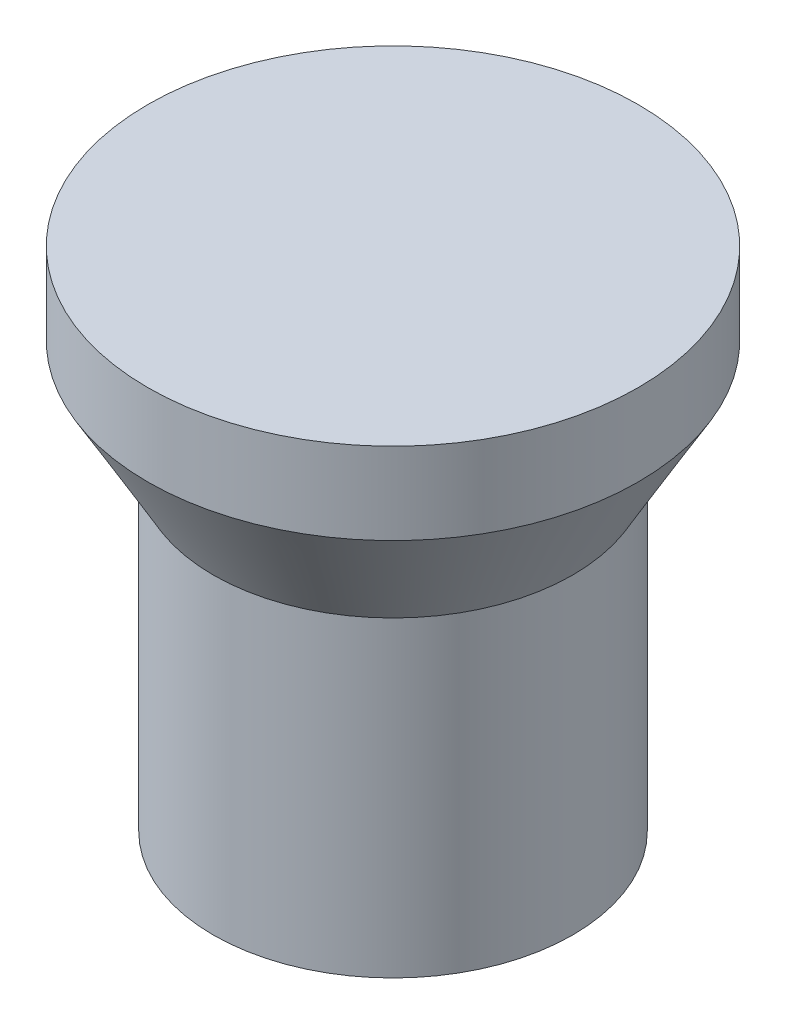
from build123d import *


with BuildPart() as part:
    # Sketch1 → Revolve1 (revolve)
    with BuildSketch(Plane.XY, mode=Mode.PRIVATE) as revolve1_sk:
        with BuildLine():
            Line((15, 31), (0, 31))
            Line((0, 31), (0, 1))
            add(Edge.make_bspline(
                [(0, 1), (6.286038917, 1), (6.636627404, 0.954391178), (9.07621245, 0.382189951), (9, 0.252396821), (9, 0)],
                knots=[0, 0, 0, 0, 0.495919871, 0.595919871, 1, 1, 1, 1], degree=3))
            Line((9, 0), (11, 0))
            Line((11, 0), (11, 19.07179677))
            Line((11, 19.07179677), (15, 26))
            Line((15, 26), (15, 31))
        make_face()
    revolve(revolve1_sk.sketch.rotate(Axis((0, 36.155378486, 0), (0, -1, 0)), 180), axis=Axis((0, 36.155378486, 0), (0, -1, 0)))


solid = part.part
